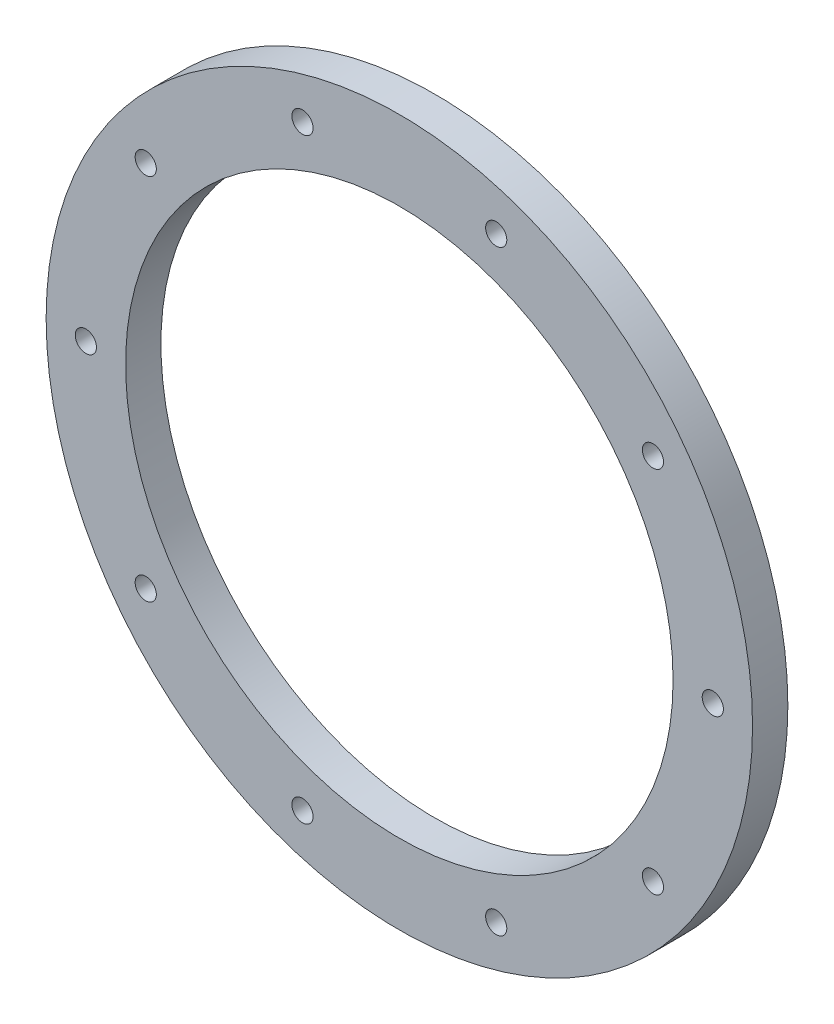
from build123d import *

# Parameters (mm, degrees)
SKETCH1_R               = 200
SKETCH1_R_2             = 155
BOSS_EXTRUDE1_DEPTH     = 20
CUT_EXTRUDE4_DEPTH      = 30
CUT_EXTRUDE4_DEPTH_BACK = 30
SKETCH2_R               = 6


with BuildPart() as part:
    # Sketch1 → Boss-Extrude1 (new body)
    with BuildSketch(Plane.XY):
        Circle(SKETCH1_R)
        Circle(SKETCH1_R_2, mode=Mode.SUBTRACT)
    extrude(amount=BOSS_EXTRUDE1_DEPTH)

    # Sketch2 → Cut-Extrude4 (cut, two sides: drawn at the far end of the back side and taken through both)
    with BuildSketch(Plane.XY.offset(-CUT_EXTRUDE4_DEPTH_BACK)):
        with Locations((-177.5, 0)):
            Circle(SKETCH2_R)
        with Locations((-143.600516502, 104.331882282)):
            Circle(SKETCH2_R)
        with Locations((-54.850516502, 168.812531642)):
            Circle(SKETCH2_R)
        with Locations((54.850516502, 168.812531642)):
            Circle(SKETCH2_R)
        with Locations((143.600516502, 104.331882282)):
            Circle(SKETCH2_R)
        with Locations((177.5, 0)):
            Circle(SKETCH2_R)
        with Locations((143.600516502, -104.331882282)):
            Circle(SKETCH2_R)
        with Locations((54.850516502, -168.812531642)):
            Circle(SKETCH2_R)
        with Locations((-54.850516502, -168.812531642)):
            Circle(SKETCH2_R)
        with Locations((-143.600516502, -104.331882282)):
            Circle(SKETCH2_R)
    extrude(amount=CUT_EXTRUDE4_DEPTH + CUT_EXTRUDE4_DEPTH_BACK, mode=Mode.SUBTRACT)


solid = part.part
